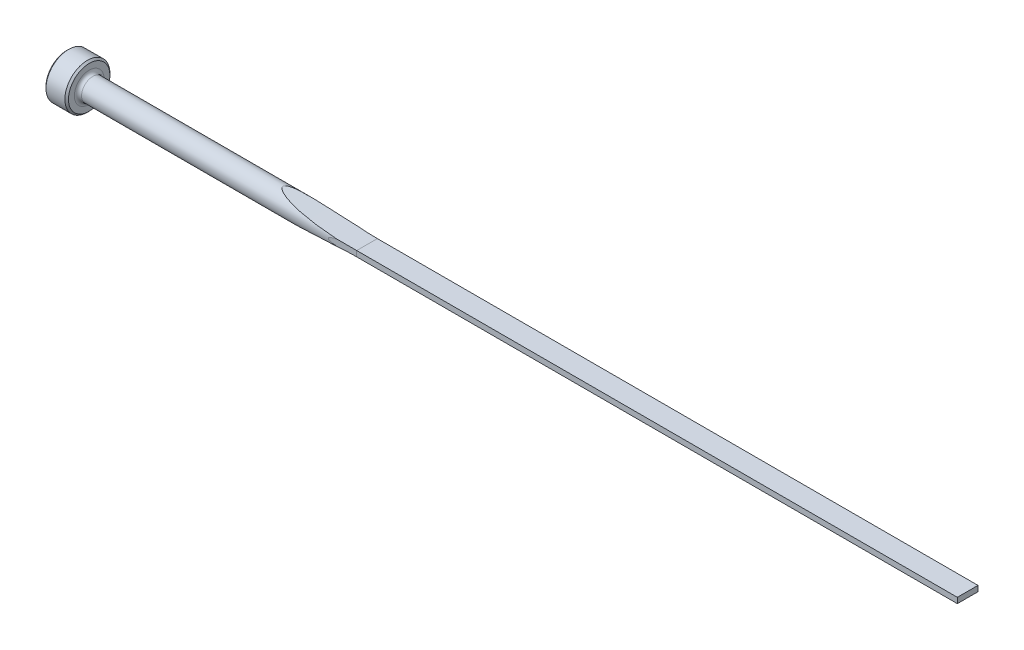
from build123d import *

# Parameters (mm, degrees)
CUT_EXTRUDE1_DEPTH = 191.619025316
CUT_EXTRUDE2_DEPTH = 191.619025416
FILLET1_R          = 0.762
CHAMFER1_SIZE      = 0.381


with BuildPart() as part:
    # Sketch1 → Revolve1 (revolve)
    with BuildSketch(Plane.XY, mode=Mode.PRIVATE) as revolve1_sk:
        Polygon((0, 0), (0, 4.7625), (4.7498, 4.7625), (4.7498, 2.3749), (190.5, 2.3749), (190.5, 0), align=None)
    revolve(revolve1_sk.sketch.rotate(Axis((0, 0, 0), (1, 0, 0)), 90), axis=Axis((0, 0, 0), (1, 0, 0)))

    # Sketch2 → Cut-Extrude1 (cut, symmetric)
    with BuildSketch(Plane.XY):
        with BuildLine():
            Line((190.5, 2.3749), (190.5, 0.5842))
            Line((190.5, 0.5842), (63.5, 0.5842))
            ThreePointArc((63.5, 0.5842), (54.578306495, 1.033007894), (45.746694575, 2.3749))
            Line((45.746694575, 2.3749), (190.5, 2.3749))
        make_face()
    cut_extrude1 = extrude(amount=CUT_EXTRUDE1_DEPTH, both=True, mode=Mode.SUBTRACT)

    # Mirror1: Cut-Extrude1 across plane
    add(cut_extrude1.mirror(Plane.ZX), mode=Mode.SUBTRACT)

    # Sketch3 → Cut-Extrude2 (cut, symmetric)
    with BuildSketch(Plane(origin=(0, 0, 0), x_dir=(1, 0, 0), z_dir=(0, 1, 0))):
        with BuildLine():
            Line((190.5, 2.3749), (190.5, 2.1844))
            Line((190.5, 2.1844), (63.5, 2.1844))
            ThreePointArc((63.5, 2.1844), (60.590064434, 2.232037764), (57.683247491, 2.3749))
            Line((57.683247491, 2.3749), (190.5, 2.3749))
        make_face()
    cut_extrude2 = extrude(amount=CUT_EXTRUDE2_DEPTH, both=True, mode=Mode.SUBTRACT)

    # Mirror2: Cut-Extrude2 across plane
    add(cut_extrude2.mirror(Plane.XY), mode=Mode.SUBTRACT)

    # Fillet1
    fillet1_edges = [part.edges().sort_by_distance(p)[0] for p in [
        (4.7498, 0, -2.3749),
    ]]
    fillet(fillet1_edges, radius=FILLET1_R)

    # Chamfer1
    chamfer1_edges = [part.edges().sort_by_distance(p)[0] for p in [
        (4.7498, 0, -4.7625),
        (0, 0, -4.7625),
    ]]
    chamfer(chamfer1_edges, length=CHAMFER1_SIZE)


solid = part.part
